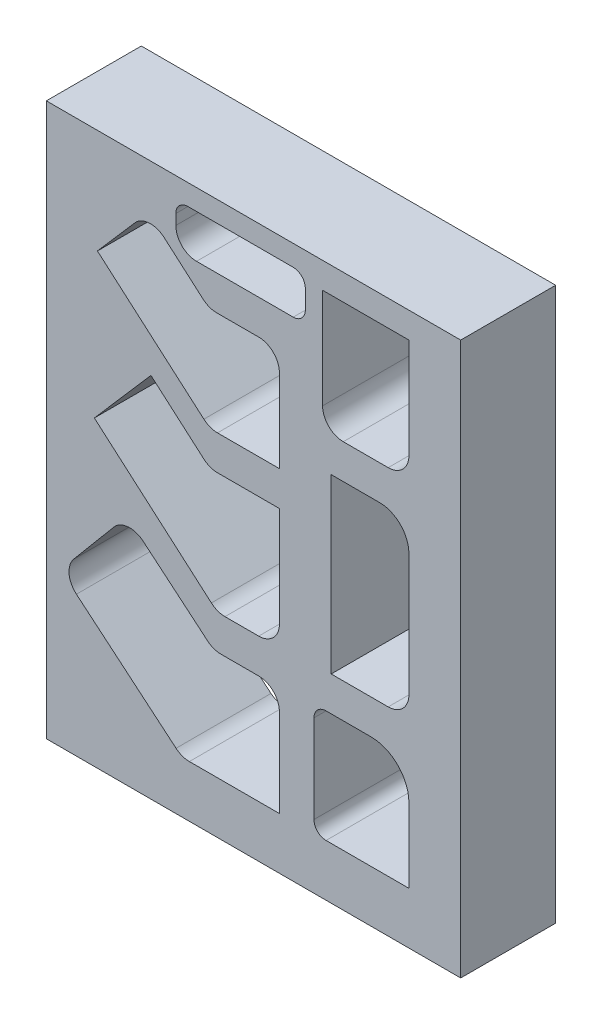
from build123d import *

# Parameters (mm, degrees)
SKETCH1_W           = 152.4
SKETCH1_H           = 203.2
BOSS_EXTRUDE1_DEPTH = 34.925


with BuildPart() as part:
    # Sketch1 → Boss-Extrude1 (new body)
    with BuildSketch(Plane.XY):
        with Locations((-57.15, 82.55)):
            Rectangle(SKETCH1_W, SKETCH1_H)
        with BuildLine():
            Line((-47.625, 0), (-47.625, 32.385))
            ThreePointArc((-47.625, 32.385), (-49.856846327, 37.773153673), (-55.245, 40.005))
            Line((-55.245, 40.005), (-69.147791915, 40.005))
            ThreePointArc((-69.147791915, 40.005), (-71.753985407, 40.46454223), (-74.045833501, 41.787741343))
            Line((-74.045833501, 41.787741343), (-97.796907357, 61.717258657))
            ThreePointArc((-97.796907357, 61.717258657), (-103.359075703, 63.471003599), (-108.5322076, 60.778041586))
            Line((-108.5322076, 60.778041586), (-123.226332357, 43.266265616))
            ThreePointArc((-123.226332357, 43.266265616), (-124.9800773, 37.704097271), (-122.287115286, 32.530965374))
            Line((-122.287115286, 32.530965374), (-85.642808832, 1.782741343))
            ThreePointArc((-85.642808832, 1.782741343), (-83.350960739, 0.45954223), (-80.744767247, 0))
            Line((-80.744767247, 0), (-47.625, 0))
        make_face(mode=Mode.SUBTRACT)
        with BuildLine():
            Line((0, 0), (0, 27.305))
            ThreePointArc((0, 27.305), (-4.091718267, 37.183281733), (-13.97, 41.275))
            Line((-13.97, 41.275), (-30.48, 41.275))
            ThreePointArc((-30.48, 41.275), (-33.623089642, 39.973089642), (-34.925, 36.83))
            Line((-34.925, 36.83), (-34.925, 4.445))
            ThreePointArc((-34.925, 4.445), (-33.623089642, 1.301910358), (-30.48, 0))
            Line((-30.48, 0), (0, 0))
        make_face(mode=Mode.SUBTRACT)
        with BuildLine():
            Line((0, 61.595), (0, 106.68))
            ThreePointArc((0, 106.68), (-3.161782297, 114.313217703), (-10.795, 117.475))
            Line((-10.795, 117.475), (-28.575, 117.475))
            Line((-28.575, 117.475), (-28.575, 53.975))
            Line((-28.575, 53.975), (-7.62, 53.975))
            ThreePointArc((-7.62, 53.975), (-2.231846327, 56.206846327), (0, 61.595))
        make_face(mode=Mode.SUBTRACT)
        with BuildLine():
            Line((-75.411278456, 99.02167063), (-94.880913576, 115.929668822))
            Line((-94.880913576, 115.929668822), (-115.699075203, 91.957463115))
            Line((-115.699075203, 91.957463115), (-72.649168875, 54.57167063))
            ThreePointArc((-72.649168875, 54.57167063), (-70.319646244, 53.186906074), (-67.652810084, 52.705))
            Line((-67.652810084, 52.705), (-55.245, 52.705))
            ThreePointArc((-55.245, 52.705), (-49.856846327, 54.936846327), (-47.625, 60.325))
            Line((-47.625, 60.325), (-47.625, 97.155))
            Line((-47.625, 97.155), (-70.414919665, 97.155))
            ThreePointArc((-70.414919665, 97.155), (-73.081755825, 97.636906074), (-75.411278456, 99.02167063))
        make_face(mode=Mode.SUBTRACT)
        with BuildLine():
            Line((-47.625, 109.855), (-47.625, 140.335))
            ThreePointArc((-47.625, 140.335), (-49.856846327, 145.723153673), (-55.245, 147.955))
            Line((-55.245, 147.955), (-70.707202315, 147.955))
            ThreePointArc((-70.707202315, 147.955), (-73.374038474, 148.436906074), (-75.703561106, 149.82167063))
            Line((-75.703561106, 149.82167063), (-90.070598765, 162.298424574))
            ThreePointArc((-90.070598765, 162.298424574), (-95.602216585, 164.146272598), (-100.820286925, 161.541453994))
            Line((-100.820286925, 161.541453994), (-114.560273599, 145.719798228))
            Line((-114.560273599, 145.719798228), (-75.411278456, 111.72167063))
            ThreePointArc((-75.411278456, 111.72167063), (-73.081755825, 110.336906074), (-70.414919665, 109.855))
            Line((-70.414919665, 109.855), (-47.625, 109.855))
        make_face(mode=Mode.SUBTRACT)
        with BuildLine():
            Line((-31.75, 174.625), (-31.75, 137.795))
            ThreePointArc((-31.75, 137.795), (-29.518153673, 132.406846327), (-24.13, 130.175))
            Line((-24.13, 130.175), (-7.62, 130.175))
            ThreePointArc((-7.62, 130.175), (-2.231846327, 132.406846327), (0, 137.795))
            Line((0, 137.795), (0, 174.625))
            Line((0, 174.625), (-31.75, 174.625))
        make_face(mode=Mode.SUBTRACT)
        with BuildLine():
            Line((-85.725, 172.085), (-85.725, 168.275))
            ThreePointArc((-85.725, 168.275), (-83.493153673, 162.886846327), (-78.105, 160.655))
            Line((-78.105, 160.655), (-42.545, 160.655))
            ThreePointArc((-42.545, 160.655), (-39.401910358, 161.956910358), (-38.1, 165.1))
            Line((-38.1, 165.1), (-38.1, 172.085))
            ThreePointArc((-38.1, 172.085), (-39.401910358, 175.228089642), (-42.545, 176.53))
            Line((-42.545, 176.53), (-81.28, 176.53))
            ThreePointArc((-81.28, 176.53), (-84.423089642, 175.228089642), (-85.725, 172.085))
        make_face(mode=Mode.SUBTRACT)
    extrude(amount=BOSS_EXTRUDE1_DEPTH)


solid = part.part
